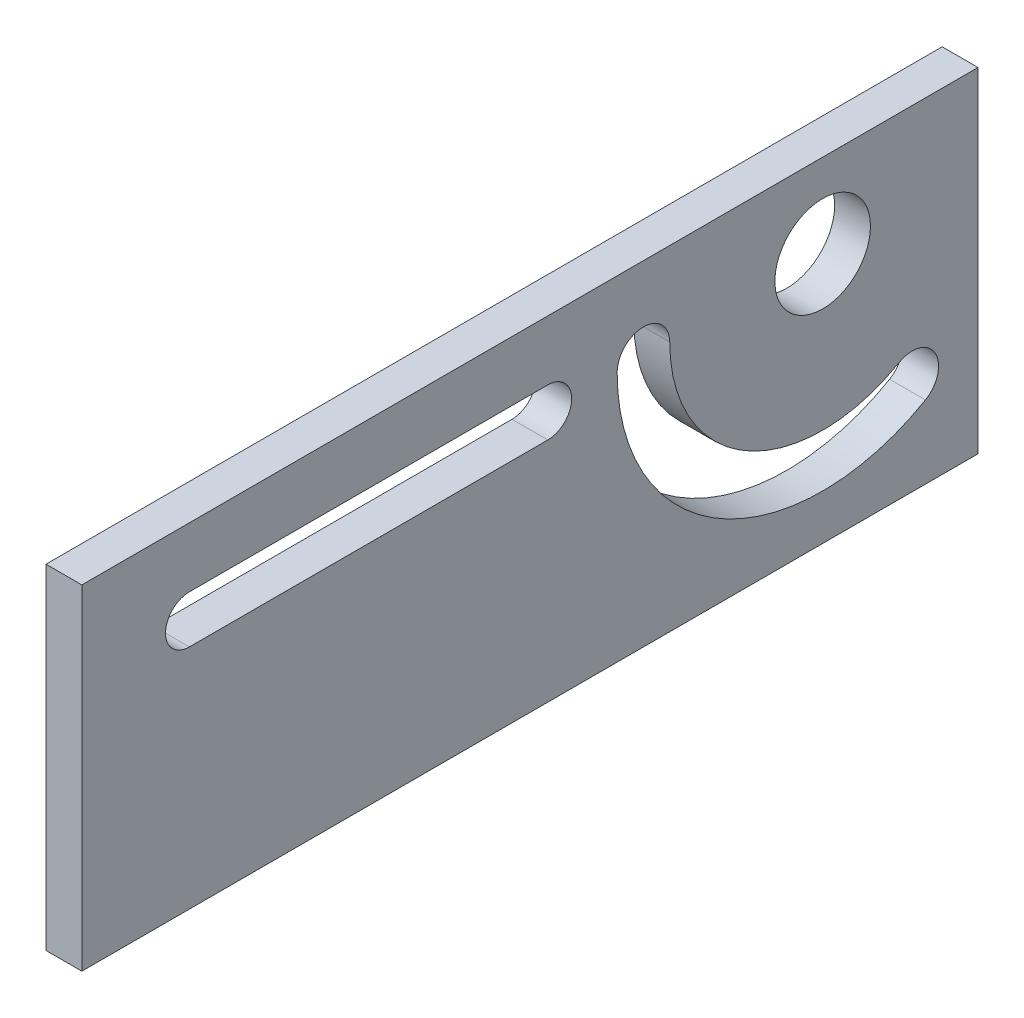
ISO-10303-21;
HEADER;
FILE_DESCRIPTION(('STEP AP214'),'2;1');
FILE_NAME('part.step','',(''),(''),'','','');
FILE_SCHEMA(('AUTOMOTIVE_DESIGN { 1 0 10303 214 1 1 1 1 }'));
ENDSEC;
DATA;
#1=APPLICATION_CONTEXT('core data for automotive mechanical design processes');
#2=APPLICATION_PROTOCOL_DEFINITION('international standard','automotive_design',2000,#1);
#3=PRODUCT_CONTEXT('',#1,'mechanical');
#4=PRODUCT('Part','Part','',(#3));
#5=PRODUCT_RELATED_PRODUCT_CATEGORY('part','',(#4));
#6=PRODUCT_DEFINITION_FORMATION('','',#4);
#7=PRODUCT_DEFINITION_CONTEXT('part definition',#1,'design');
#8=PRODUCT_DEFINITION('design','',#6,#7);
#9=PRODUCT_DEFINITION_SHAPE('','',#8);
#10=(LENGTH_UNIT() NAMED_UNIT(*) SI_UNIT(.MILLI.,.METRE.));
#11=(NAMED_UNIT(*) PLANE_ANGLE_UNIT() SI_UNIT($,.RADIAN.));
#12=(NAMED_UNIT(*) SI_UNIT($,.STERADIAN.) SOLID_ANGLE_UNIT());
#13=UNCERTAINTY_MEASURE_WITH_UNIT(LENGTH_MEASURE(1.E-05),#10,'distance_accuracy_value','');
#14=(GEOMETRIC_REPRESENTATION_CONTEXT(3) GLOBAL_UNCERTAINTY_ASSIGNED_CONTEXT((#13)) GLOBAL_UNIT_ASSIGNED_CONTEXT((#10,
#11,#12)) REPRESENTATION_CONTEXT('',''));
#15=CARTESIAN_POINT('',(0.,0.,0.));
#16=DIRECTION('',(0.,0.,1.));
#17=DIRECTION('',(1.,0.,0.));
#18=AXIS2_PLACEMENT_3D('',#15,#16,#17);
#19=CARTESIAN_POINT('',(108.,0.,37.5));
#20=DIRECTION('',(0.,0.,1.));
#21=DIRECTION('',(1.,0.,0.));
#22=AXIS2_PLACEMENT_3D('',#19,#20,#21);
#23=PLANE('',#22);
#24=DIRECTION('',(0.,1.,0.));
#25=VECTOR('',#24,1.);
#26=CARTESIAN_POINT('',(105.,0.,37.5));
#27=LINE('',#26,#25);
#28=CARTESIAN_POINT('',(105.,66.,37.5));
#29=VERTEX_POINT('',#28);
#30=CARTESIAN_POINT('',(105.,94.,37.5));
#31=VERTEX_POINT('',#30);
#32=EDGE_CURVE('E182',#29,#31,#27,.T.);
#33=ORIENTED_EDGE('',*,*,#32,.T.);
#34=DIRECTION('',(-1.,0.,0.));
#35=VECTOR('',#34,1.);
#36=CARTESIAN_POINT('',(108.,94.,37.5));
#37=LINE('',#36,#35);
#38=CARTESIAN_POINT('',(108.,94.,37.5));
#39=VERTEX_POINT('',#38);
#40=EDGE_CURVE('E11',#39,#31,#37,.T.);
#41=ORIENTED_EDGE('',*,*,#40,.F.);
#42=DIRECTION('',(0.,1.,0.));
#43=VECTOR('',#42,1.);
#44=CARTESIAN_POINT('',(108.,0.,37.5));
#45=LINE('',#44,#43);
#46=CARTESIAN_POINT('',(108.,66.,37.5));
#47=VERTEX_POINT('',#46);
#48=EDGE_CURVE('E139',#47,#39,#45,.T.);
#49=ORIENTED_EDGE('',*,*,#48,.F.);
#50=DIRECTION('',(-1.,0.,0.));
#51=VECTOR('',#50,1.);
#52=CARTESIAN_POINT('',(108.,66.,37.5));
#53=LINE('',#52,#51);
#54=EDGE_CURVE('E54',#47,#29,#53,.T.);
#55=ORIENTED_EDGE('',*,*,#54,.T.);
#56=EDGE_LOOP('',(#33,#41,#49,#55));
#57=FACE_BOUND('',#56,.T.);
#58=ADVANCED_FACE('F35',(#57),#23,.F.);
#59=CARTESIAN_POINT('',(108.,94.,0.));
#60=DIRECTION('',(0.,-1.,0.));
#61=DIRECTION('',(0.,0.,-1.));
#62=AXIS2_PLACEMENT_3D('',#59,#60,#61);
#63=PLANE('',#62);
#64=DIRECTION('',(0.,0.,1.));
#65=VECTOR('',#64,1.);
#66=CARTESIAN_POINT('',(105.,94.,0.));
#67=LINE('',#66,#65);
#68=CARTESIAN_POINT('',(105.,94.,112.5));
#69=VERTEX_POINT('',#68);
#70=EDGE_CURVE('E145',#31,#69,#67,.T.);
#71=ORIENTED_EDGE('',*,*,#70,.T.);
#72=DIRECTION('',(-1.,0.,0.));
#73=VECTOR('',#72,1.);
#74=CARTESIAN_POINT('',(108.,94.,112.5));
#75=LINE('',#74,#73);
#76=CARTESIAN_POINT('',(108.,94.,112.5));
#77=VERTEX_POINT('',#76);
#78=EDGE_CURVE('E45',#77,#69,#75,.T.);
#79=ORIENTED_EDGE('',*,*,#78,.F.);
#80=DIRECTION('',(0.,0.,1.));
#81=VECTOR('',#80,1.);
#82=CARTESIAN_POINT('',(108.,94.,0.));
#83=LINE('',#82,#81);
#84=EDGE_CURVE('E132',#39,#77,#83,.T.);
#85=ORIENTED_EDGE('',*,*,#84,.F.);
#86=ORIENTED_EDGE('',*,*,#40,.T.);
#87=EDGE_LOOP('',(#71,#79,#85,#86));
#88=FACE_BOUND('',#87,.T.);
#89=ADVANCED_FACE('F144',(#88),#63,.F.);
#90=CARTESIAN_POINT('',(108.,0.,112.5));
#91=DIRECTION('',(0.,0.,1.));
#92=DIRECTION('',(1.,0.,0.));
#93=AXIS2_PLACEMENT_3D('',#90,#91,#92);
#94=PLANE('',#93);
#95=DIRECTION('',(0.,1.,0.));
#96=VECTOR('',#95,1.);
#97=CARTESIAN_POINT('',(105.,0.,112.5));
#98=LINE('',#97,#96);
#99=CARTESIAN_POINT('',(105.,66.,112.5));
#100=VERTEX_POINT('',#99);
#101=EDGE_CURVE('E185',#100,#69,#98,.T.);
#102=ORIENTED_EDGE('',*,*,#101,.F.);
#103=DIRECTION('',(-1.,0.,0.));
#104=VECTOR('',#103,1.);
#105=CARTESIAN_POINT('',(108.,66.,112.5));
#106=LINE('',#105,#104);
#107=CARTESIAN_POINT('',(108.,66.,112.5));
#108=VERTEX_POINT('',#107);
#109=EDGE_CURVE('E92',#108,#100,#106,.T.);
#110=ORIENTED_EDGE('',*,*,#109,.F.);
#111=DIRECTION('',(0.,1.,0.));
#112=VECTOR('',#111,1.);
#113=CARTESIAN_POINT('',(108.,0.,112.5));
#114=LINE('',#113,#112);
#115=EDGE_CURVE('E138',#108,#77,#114,.T.);
#116=ORIENTED_EDGE('',*,*,#115,.T.);
#117=ORIENTED_EDGE('',*,*,#78,.T.);
#118=EDGE_LOOP('',(#102,#110,#116,#117));
#119=FACE_BOUND('',#118,.T.);
#120=ADVANCED_FACE('F149',(#119),#94,.T.);
#121=CARTESIAN_POINT('',(108.,87.,73.5));
#122=DIRECTION('',(-1.,0.,0.));
#123=DIRECTION('',(0.,0.,1.));
#124=AXIS2_PLACEMENT_3D('',#121,#122,#123);
#125=CYLINDRICAL_SURFACE('',#124,1.9959873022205);
#126=CARTESIAN_POINT('',(105.,87.,73.5));
#127=DIRECTION('',(1.,0.,0.));
#128=DIRECTION('',(0.,0.,-1.));
#129=AXIS2_PLACEMENT_3D('',#126,#127,#128);
#130=CIRCLE('',#129,1.9959873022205);
#131=CARTESIAN_POINT('',(105.,85.0040126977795,73.5));
#132=VERTEX_POINT('',#131);
#133=CARTESIAN_POINT('',(105.,88.9959873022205,73.5));
#134=VERTEX_POINT('',#133);
#135=EDGE_CURVE('E170',#132,#134,#130,.T.);
#136=ORIENTED_EDGE('',*,*,#135,.F.);
#137=DIRECTION('',(-1.,0.,0.));
#138=VECTOR('',#137,1.);
#139=CARTESIAN_POINT('',(108.,85.0040126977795,73.5));
#140=LINE('',#139,#138);
#141=CARTESIAN_POINT('',(108.,85.0040126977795,73.5));
#142=VERTEX_POINT('',#141);
#143=EDGE_CURVE('E195',#142,#132,#140,.T.);
#144=ORIENTED_EDGE('',*,*,#143,.F.);
#145=CARTESIAN_POINT('',(108.,87.,73.5));
#146=DIRECTION('',(1.,0.,0.));
#147=DIRECTION('',(0.,0.,-1.));
#148=AXIS2_PLACEMENT_3D('',#145,#146,#147);
#149=CIRCLE('',#148,1.9959873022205);
#150=CARTESIAN_POINT('',(108.,88.9959873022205,73.5));
#151=VERTEX_POINT('',#150);
#152=EDGE_CURVE('E378',#142,#151,#149,.T.);
#153=ORIENTED_EDGE('',*,*,#152,.T.);
#154=DIRECTION('',(-1.,0.,0.));
#155=VECTOR('',#154,1.);
#156=CARTESIAN_POINT('',(108.,88.9959873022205,73.5));
#157=LINE('',#156,#155);
#158=EDGE_CURVE('E197',#151,#134,#157,.T.);
#159=ORIENTED_EDGE('',*,*,#158,.T.);
#160=EDGE_LOOP('',(#136,#144,#153,#159));
#161=FACE_BOUND('',#160,.T.);
#162=ADVANCED_FACE('F256',(#161),#125,.F.);
#163=CARTESIAN_POINT('',(108.,85.0040126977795,0.));
#164=DIRECTION('',(0.,1.,0.));
#165=DIRECTION('',(0.,0.,1.));
#166=AXIS2_PLACEMENT_3D('',#163,#164,#165);
#167=PLANE('',#166);
#168=DIRECTION('',(0.,0.,-1.));
#169=VECTOR('',#168,1.);
#170=CARTESIAN_POINT('',(105.,85.0040126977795,0.));
#171=LINE('',#170,#169);
#172=CARTESIAN_POINT('',(105.,85.0040126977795,103.5));
#173=VERTEX_POINT('',#172);
#174=EDGE_CURVE('E173',#173,#132,#171,.T.);
#175=ORIENTED_EDGE('',*,*,#174,.F.);
#176=DIRECTION('',(-1.,0.,0.));
#177=VECTOR('',#176,1.);
#178=CARTESIAN_POINT('',(108.,85.0040126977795,103.5));
#179=LINE('',#178,#177);
#180=CARTESIAN_POINT('',(108.,85.0040126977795,103.5));
#181=VERTEX_POINT('',#180);
#182=EDGE_CURVE('E201',#181,#173,#179,.T.);
#183=ORIENTED_EDGE('',*,*,#182,.F.);
#184=DIRECTION('',(0.,0.,-1.));
#185=VECTOR('',#184,1.);
#186=CARTESIAN_POINT('',(108.,85.0040126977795,0.));
#187=LINE('',#186,#185);
#188=EDGE_CURVE('E381',#181,#142,#187,.T.);
#189=ORIENTED_EDGE('',*,*,#188,.T.);
#190=ORIENTED_EDGE('',*,*,#143,.T.);
#191=EDGE_LOOP('',(#175,#183,#189,#190));
#192=FACE_BOUND('',#191,.T.);
#193=ADVANCED_FACE('F252',(#192),#167,.T.);
#194=CARTESIAN_POINT('',(108.,87.,103.5));
#195=DIRECTION('',(-1.,0.,0.));
#196=DIRECTION('',(0.,0.,1.));
#197=AXIS2_PLACEMENT_3D('',#194,#195,#196);
#198=CYLINDRICAL_SURFACE('',#197,1.9959873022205);
#199=CARTESIAN_POINT('',(105.,87.,103.5));
#200=DIRECTION('',(1.,0.,0.));
#201=DIRECTION('',(0.,0.,-1.));
#202=AXIS2_PLACEMENT_3D('',#199,#200,#201);
#203=CIRCLE('',#202,1.9959873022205);
#204=CARTESIAN_POINT('',(105.,88.9959873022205,103.5));
#205=VERTEX_POINT('',#204);
#206=EDGE_CURVE('E176',#205,#173,#203,.T.);
#207=ORIENTED_EDGE('',*,*,#206,.F.);
#208=DIRECTION('',(-1.,0.,0.));
#209=VECTOR('',#208,1.);
#210=CARTESIAN_POINT('',(108.,88.9959873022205,103.5));
#211=LINE('',#210,#209);
#212=CARTESIAN_POINT('',(108.,88.9959873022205,103.5));
#213=VERTEX_POINT('',#212);
#214=EDGE_CURVE('E199',#213,#205,#211,.T.);
#215=ORIENTED_EDGE('',*,*,#214,.F.);
#216=CARTESIAN_POINT('',(108.,87.,103.5));
#217=DIRECTION('',(1.,0.,0.));
#218=DIRECTION('',(0.,0.,-1.));
#219=AXIS2_PLACEMENT_3D('',#216,#217,#218);
#220=CIRCLE('',#219,1.9959873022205);
#221=EDGE_CURVE('E389',#213,#181,#220,.T.);
#222=ORIENTED_EDGE('',*,*,#221,.T.);
#223=ORIENTED_EDGE('',*,*,#182,.T.);
#224=EDGE_LOOP('',(#207,#215,#222,#223));
#225=FACE_BOUND('',#224,.T.);
#226=ADVANCED_FACE('F249',(#225),#198,.F.);
#227=CARTESIAN_POINT('',(108.,87.,50.5));
#228=DIRECTION('',(-1.,0.,0.));
#229=DIRECTION('',(0.,0.,1.));
#230=AXIS2_PLACEMENT_3D('',#227,#228,#229);
#231=CYLINDRICAL_SURFACE('',#230,12.8);
#232=CARTESIAN_POINT('',(105.,87.,50.5));
#233=DIRECTION('',(1.,0.,0.));
#234=DIRECTION('',(0.,0.,-1.));
#235=AXIS2_PLACEMENT_3D('',#232,#233,#234);
#236=CIRCLE('',#235,12.8);
#237=CARTESIAN_POINT('',(105.,75.9148748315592,44.1));
#238=VERTEX_POINT('',#237);
#239=CARTESIAN_POINT('',(105.,87.,63.3));
#240=VERTEX_POINT('',#239);
#241=EDGE_CURVE('E159',#238,#240,#236,.F.);
#242=ORIENTED_EDGE('',*,*,#241,.F.);
#243=DIRECTION('',(-1.,0.,0.));
#244=VECTOR('',#243,1.);
#245=CARTESIAN_POINT('',(108.,75.9148748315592,44.1));
#246=LINE('',#245,#244);
#247=CARTESIAN_POINT('',(108.,75.9148748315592,44.1));
#248=VERTEX_POINT('',#247);
#249=EDGE_CURVE('E39',#248,#238,#246,.T.);
#250=ORIENTED_EDGE('',*,*,#249,.F.);
#251=CARTESIAN_POINT('',(108.,87.,50.5));
#252=DIRECTION('',(1.,0.,0.));
#253=DIRECTION('',(0.,0.,-1.));
#254=AXIS2_PLACEMENT_3D('',#251,#252,#253);
#255=CIRCLE('',#254,12.8);
#256=CARTESIAN_POINT('',(108.,87.,63.3));
#257=VERTEX_POINT('',#256);
#258=EDGE_CURVE('E193',#248,#257,#255,.F.);
#259=ORIENTED_EDGE('',*,*,#258,.T.);
#260=DIRECTION('',(-1.,0.,0.));
#261=VECTOR('',#260,1.);
#262=CARTESIAN_POINT('',(108.,87.,63.3));
#263=LINE('',#262,#261);
#264=EDGE_CURVE('E158',#257,#240,#263,.T.);
#265=ORIENTED_EDGE('',*,*,#264,.T.);
#266=EDGE_LOOP('',(#242,#250,#259,#265));
#267=FACE_BOUND('',#266,.T.);
#268=ADVANCED_FACE('F37',(#267),#231,.T.);
#269=CARTESIAN_POINT('',(108.,74.0096189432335,43.));
#270=DIRECTION('',(-1.,0.,0.));
#271=DIRECTION('',(0.,0.,1.));
#272=AXIS2_PLACEMENT_3D('',#269,#270,#271);
#273=CYLINDRICAL_SURFACE('',#272,2.19999999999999);
#274=CARTESIAN_POINT('',(105.,74.0096189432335,43.));
#275=DIRECTION('',(1.,0.,0.));
#276=DIRECTION('',(0.,0.,-1.));
#277=AXIS2_PLACEMENT_3D('',#274,#275,#276);
#278=CIRCLE('',#277,2.19999999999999);
#279=CARTESIAN_POINT('',(105.,72.1043630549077,41.9));
#280=VERTEX_POINT('',#279);
#281=EDGE_CURVE('E162',#238,#280,#278,.F.);
#282=ORIENTED_EDGE('',*,*,#281,.T.);
#283=DIRECTION('',(-1.,0.,0.));
#284=VECTOR('',#283,1.);
#285=CARTESIAN_POINT('',(108.,72.1043630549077,41.9));
#286=LINE('',#285,#284);
#287=CARTESIAN_POINT('',(108.,72.1043630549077,41.9));
#288=VERTEX_POINT('',#287);
#289=EDGE_CURVE('E206',#288,#280,#286,.T.);
#290=ORIENTED_EDGE('',*,*,#289,.F.);
#291=CARTESIAN_POINT('',(108.,74.0096189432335,43.));
#292=DIRECTION('',(1.,0.,0.));
#293=DIRECTION('',(0.,0.,-1.));
#294=AXIS2_PLACEMENT_3D('',#291,#292,#293);
#295=CIRCLE('',#294,2.19999999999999);
#296=EDGE_CURVE('E215',#248,#288,#295,.F.);
#297=ORIENTED_EDGE('',*,*,#296,.F.);
#298=ORIENTED_EDGE('',*,*,#249,.T.);
#299=EDGE_LOOP('',(#282,#290,#297,#298));
#300=FACE_BOUND('',#299,.T.);
#301=ADVANCED_FACE('F214',(#300),#273,.F.);
#302=CARTESIAN_POINT('',(108.,87.,50.5));
#303=DIRECTION('',(-1.,0.,0.));
#304=DIRECTION('',(0.,0.,1.));
#305=AXIS2_PLACEMENT_3D('',#302,#303,#304);
#306=CYLINDRICAL_SURFACE('',#305,17.2);
#307=CARTESIAN_POINT('',(105.,87.,50.5));
#308=DIRECTION('',(1.,0.,0.));
#309=DIRECTION('',(0.,0.,-1.));
#310=AXIS2_PLACEMENT_3D('',#307,#308,#309);
#311=CIRCLE('',#310,17.2);
#312=CARTESIAN_POINT('',(105.,87.,67.7));
#313=VERTEX_POINT('',#312);
#314=EDGE_CURVE('E164',#280,#313,#311,.F.);
#315=ORIENTED_EDGE('',*,*,#314,.T.);
#316=DIRECTION('',(-1.,0.,0.));
#317=VECTOR('',#316,1.);
#318=CARTESIAN_POINT('',(108.,87.,67.7));
#319=LINE('',#318,#317);
#320=CARTESIAN_POINT('',(108.,87.,67.7));
#321=VERTEX_POINT('',#320);
#322=EDGE_CURVE('E205',#321,#313,#319,.T.);
#323=ORIENTED_EDGE('',*,*,#322,.F.);
#324=CARTESIAN_POINT('',(108.,87.,50.5));
#325=DIRECTION('',(1.,0.,0.));
#326=DIRECTION('',(0.,0.,-1.));
#327=AXIS2_PLACEMENT_3D('',#324,#325,#326);
#328=CIRCLE('',#327,17.2);
#329=EDGE_CURVE('E395',#288,#321,#328,.F.);
#330=ORIENTED_EDGE('',*,*,#329,.F.);
#331=ORIENTED_EDGE('',*,*,#289,.T.);
#332=EDGE_LOOP('',(#315,#323,#330,#331));
#333=FACE_BOUND('',#332,.T.);
#334=ADVANCED_FACE('F227',(#333),#306,.F.);
#335=CARTESIAN_POINT('',(108.,66.,0.));
#336=DIRECTION('',(0.,-1.,0.));
#337=DIRECTION('',(0.,0.,-1.));
#338=AXIS2_PLACEMENT_3D('',#335,#336,#337);
#339=PLANE('',#338);
#340=DIRECTION('',(0.,0.,1.));
#341=VECTOR('',#340,1.);
#342=CARTESIAN_POINT('',(105.,66.,0.));
#343=LINE('',#342,#341);
#344=EDGE_CURVE('E187',#29,#100,#343,.T.);
#345=ORIENTED_EDGE('',*,*,#344,.F.);
#346=ORIENTED_EDGE('',*,*,#54,.F.);
#347=DIRECTION('',(0.,0.,1.));
#348=VECTOR('',#347,1.);
#349=CARTESIAN_POINT('',(108.,66.,0.));
#350=LINE('',#349,#348);
#351=EDGE_CURVE('E150',#47,#108,#350,.T.);
#352=ORIENTED_EDGE('',*,*,#351,.T.);
#353=ORIENTED_EDGE('',*,*,#109,.T.);
#354=EDGE_LOOP('',(#345,#346,#352,#353));
#355=FACE_BOUND('',#354,.T.);
#356=ADVANCED_FACE('F229',(#355),#339,.T.);
#357=CARTESIAN_POINT('',(108.,88.9959873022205,0.));
#358=DIRECTION('',(0.,1.,0.));
#359=DIRECTION('',(0.,0.,1.));
#360=AXIS2_PLACEMENT_3D('',#357,#358,#359);
#361=PLANE('',#360);
#362=DIRECTION('',(0.,0.,-1.));
#363=VECTOR('',#362,1.);
#364=CARTESIAN_POINT('',(105.,88.9959873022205,0.));
#365=LINE('',#364,#363);
#366=EDGE_CURVE('E179',#205,#134,#365,.T.);
#367=ORIENTED_EDGE('',*,*,#366,.T.);
#368=ORIENTED_EDGE('',*,*,#158,.F.);
#369=DIRECTION('',(0.,0.,-1.));
#370=VECTOR('',#369,1.);
#371=CARTESIAN_POINT('',(108.,88.9959873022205,0.));
#372=LINE('',#371,#370);
#373=EDGE_CURVE('E384',#213,#151,#372,.T.);
#374=ORIENTED_EDGE('',*,*,#373,.F.);
#375=ORIENTED_EDGE('',*,*,#214,.T.);
#376=EDGE_LOOP('',(#367,#368,#374,#375));
#377=FACE_BOUND('',#376,.T.);
#378=ADVANCED_FACE('F235',(#377),#361,.F.);
#379=CARTESIAN_POINT('',(108.,87.,65.5));
#380=DIRECTION('',(-1.,0.,0.));
#381=DIRECTION('',(0.,0.,1.));
#382=AXIS2_PLACEMENT_3D('',#379,#380,#381);
#383=CYLINDRICAL_SURFACE('',#382,2.20000000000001);
#384=CARTESIAN_POINT('',(105.,87.,65.5));
#385=DIRECTION('',(1.,0.,0.));
#386=DIRECTION('',(0.,0.,-1.));
#387=AXIS2_PLACEMENT_3D('',#384,#385,#386);
#388=CIRCLE('',#387,2.20000000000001);
#389=EDGE_CURVE('E167',#240,#313,#388,.T.);
#390=ORIENTED_EDGE('',*,*,#389,.F.);
#391=ORIENTED_EDGE('',*,*,#264,.F.);
#392=CARTESIAN_POINT('',(108.,87.,65.5));
#393=DIRECTION('',(1.,0.,0.));
#394=DIRECTION('',(0.,0.,-1.));
#395=AXIS2_PLACEMENT_3D('',#392,#393,#394);
#396=CIRCLE('',#395,2.20000000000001);
#397=EDGE_CURVE('E225',#257,#321,#396,.T.);
#398=ORIENTED_EDGE('',*,*,#397,.T.);
#399=ORIENTED_EDGE('',*,*,#322,.T.);
#400=EDGE_LOOP('',(#390,#391,#398,#399));
#401=FACE_BOUND('',#400,.T.);
#402=ADVANCED_FACE('F224',(#401),#383,.F.);
#403=CARTESIAN_POINT('',(108.,87.,50.5));
#404=DIRECTION('',(-1.,0.,0.));
#405=DIRECTION('',(0.,0.,1.));
#406=AXIS2_PLACEMENT_3D('',#403,#404,#405);
#407=CYLINDRICAL_SURFACE('',#406,4.00000000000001);
#408=CARTESIAN_POINT('',(108.,87.,50.5));
#409=DIRECTION('',(1.,0.,0.));
#410=DIRECTION('',(0.,0.,-1.));
#411=AXIS2_PLACEMENT_3D('',#408,#409,#410);
#412=CIRCLE('',#411,4.00000000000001);
#413=CARTESIAN_POINT('',(108.,87.,46.5));
#414=VERTEX_POINT('',#413);
#415=EDGE_CURVE('E152',#414,#414,#412,.F.);
#416=ORIENTED_EDGE('',*,*,#415,.F.);
#417=EDGE_LOOP('',(#416));
#418=FACE_BOUND('',#417,.T.);
#419=CARTESIAN_POINT('',(105.,87.,50.5));
#420=DIRECTION('',(1.,0.,0.));
#421=DIRECTION('',(0.,0.,-1.));
#422=AXIS2_PLACEMENT_3D('',#419,#420,#421);
#423=CIRCLE('',#422,4.00000000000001);
#424=CARTESIAN_POINT('',(105.,87.,46.5));
#425=VERTEX_POINT('',#424);
#426=EDGE_CURVE('E190',#425,#425,#423,.F.);
#427=ORIENTED_EDGE('',*,*,#426,.T.);
#428=EDGE_LOOP('',(#427));
#429=FACE_BOUND('',#428,.T.);
#430=ADVANCED_FACE('F261',(#418,#429),#407,.F.);
#431=CARTESIAN_POINT('',(108.,0.,0.));
#432=DIRECTION('',(1.,0.,0.));
#433=DIRECTION('',(0.,0.,-1.));
#434=AXIS2_PLACEMENT_3D('',#431,#432,#433);
#435=PLANE('',#434);
#436=ORIENTED_EDGE('',*,*,#258,.F.);
#437=ORIENTED_EDGE('',*,*,#296,.T.);
#438=ORIENTED_EDGE('',*,*,#329,.T.);
#439=ORIENTED_EDGE('',*,*,#397,.F.);
#440=EDGE_LOOP('',(#436,#437,#438,#439));
#441=FACE_BOUND('',#440,.T.);
#442=ORIENTED_EDGE('',*,*,#152,.F.);
#443=ORIENTED_EDGE('',*,*,#188,.F.);
#444=ORIENTED_EDGE('',*,*,#221,.F.);
#445=ORIENTED_EDGE('',*,*,#373,.T.);
#446=EDGE_LOOP('',(#442,#443,#444,#445));
#447=FACE_BOUND('',#446,.T.);
#448=ORIENTED_EDGE('',*,*,#48,.T.);
#449=ORIENTED_EDGE('',*,*,#84,.T.);
#450=ORIENTED_EDGE('',*,*,#115,.F.);
#451=ORIENTED_EDGE('',*,*,#351,.F.);
#452=EDGE_LOOP('',(#448,#449,#450,#451));
#453=FACE_BOUND('',#452,.T.);
#454=ORIENTED_EDGE('',*,*,#415,.T.);
#455=EDGE_LOOP('',(#454));
#456=FACE_BOUND('',#455,.T.);
#457=ADVANCED_FACE('F134',(#441,#447,#453,#456),#435,.T.);
#458=CARTESIAN_POINT('',(105.,0.,0.));
#459=DIRECTION('',(1.,0.,0.));
#460=DIRECTION('',(0.,0.,-1.));
#461=AXIS2_PLACEMENT_3D('',#458,#459,#460);
#462=PLANE('',#461);
#463=ORIENTED_EDGE('',*,*,#241,.T.);
#464=ORIENTED_EDGE('',*,*,#389,.T.);
#465=ORIENTED_EDGE('',*,*,#314,.F.);
#466=ORIENTED_EDGE('',*,*,#281,.F.);
#467=EDGE_LOOP('',(#463,#464,#465,#466));
#468=FACE_BOUND('',#467,.T.);
#469=ORIENTED_EDGE('',*,*,#135,.T.);
#470=ORIENTED_EDGE('',*,*,#366,.F.);
#471=ORIENTED_EDGE('',*,*,#206,.T.);
#472=ORIENTED_EDGE('',*,*,#174,.T.);
#473=EDGE_LOOP('',(#469,#470,#471,#472));
#474=FACE_BOUND('',#473,.T.);
#475=ORIENTED_EDGE('',*,*,#32,.F.);
#476=ORIENTED_EDGE('',*,*,#344,.T.);
#477=ORIENTED_EDGE('',*,*,#101,.T.);
#478=ORIENTED_EDGE('',*,*,#70,.F.);
#479=EDGE_LOOP('',(#475,#476,#477,#478));
#480=FACE_BOUND('',#479,.T.);
#481=ORIENTED_EDGE('',*,*,#426,.F.);
#482=EDGE_LOOP('',(#481));
#483=FACE_BOUND('',#482,.T.);
#484=ADVANCED_FACE('F218',(#468,#474,#480,#483),#462,.F.);
#485=CLOSED_SHELL('',(#58,#89,#120,#162,#193,#226,#268,#301,#334,#356,#378,#402,#430,#457,#484));
#486=MANIFOLD_SOLID_BREP('B2',#485);
#487=ADVANCED_BREP_SHAPE_REPRESENTATION('',(#18,#486),#14);
#488=SHAPE_DEFINITION_REPRESENTATION(#9,#487);
ENDSEC;
END-ISO-10303-21;
